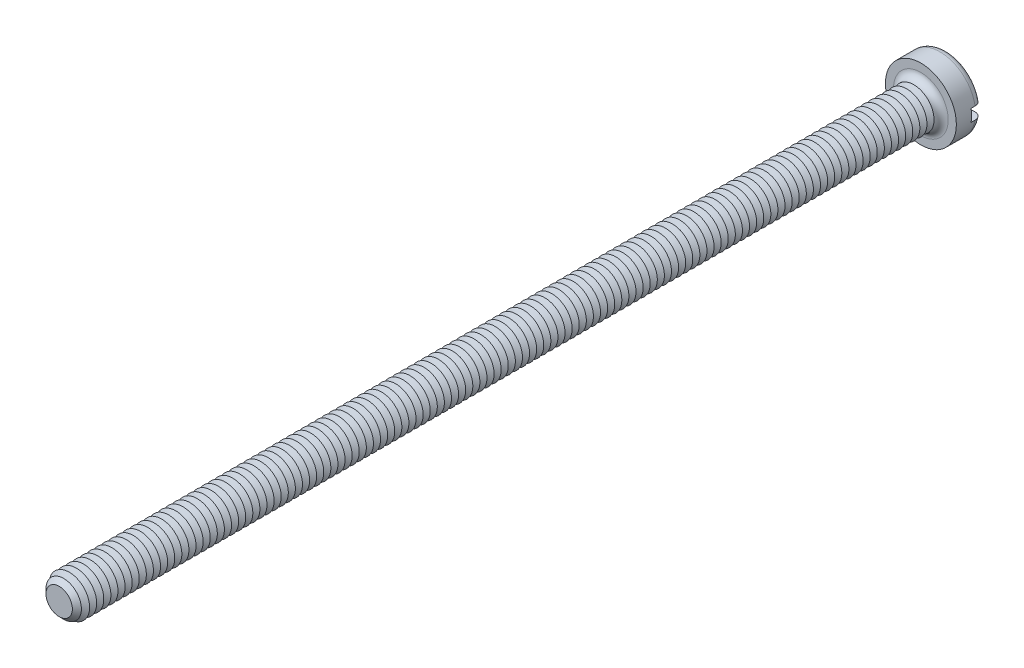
from build123d import *

# Parameters (mm, degrees)
SKETCH3_R           = 3.5
BOSS_EXTRUDE2_DEPTH = 2.6
SKETCH4_R           = 2
BOSS_EXTRUDE3_DEPTH = 85
FILLET1_R           = 0.7
CHAMFER1_SIZE       = 0.7
LPATTERN1_COUNT     = 120
LPATTERN1_PITCH     = 0.7
SKETCH8_W           = 7
SKETCH8_H           = 1.2
CUT_EXTRUDE1_DEPTH  = 1.1


with BuildPart() as part:
    # Sketch3 → Boss-Extrude2 (new body)
    with BuildSketch(Plane.XY):
        Circle(SKETCH3_R)
    extrude(amount=-BOSS_EXTRUDE2_DEPTH)

    # Sketch4 → Boss-Extrude3 (add)
    with BuildSketch(Plane.XY):
        Circle(SKETCH4_R)
    extrude(amount=BOSS_EXTRUDE3_DEPTH)

    # Fillet1
    fillet1_edges = [part.edges().sort_by_distance(p)[0] for p in [
        (-3.5, 0, -2.6),
        (-2, 0, 0),
    ]]
    fillet(fillet1_edges, radius=FILLET1_R)

    # Chamfer1
    chamfer1_edges = [part.edges().sort_by_distance(p)[0] for p in [
        (-2, 0, 85),
    ]]
    chamfer(chamfer1_edges, length=CHAMFER1_SIZE)

    # Sketch6 → Cut-Revolve1 (revolve, cut)
    with BuildSketch(Plane(origin=(0, 0, 0), x_dir=(0, 0, -1), z_dir=(1, 0, 0)), mode=Mode.PRIVATE) as cut_revolve1_sk:
        Polygon((-0.7, 2), (-1.05, 1.393782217), (-1.4, 2), align=None)
    cut_revolve1 = revolve(cut_revolve1_sk.sketch.rotate(Axis((0, 0, -1.694361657), (0, 0, 1)), 90), axis=Axis((0, 0, -1.694361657), (0, 0, 1)), mode=Mode.SUBTRACT)

    # LPattern1: Cut-Revolve1 ×120
    with Locations(*[(0, 0, i * LPATTERN1_PITCH) for i in range(1, LPATTERN1_COUNT)]):
        add(cut_revolve1, mode=Mode.SUBTRACT)

    # Sketch8 → Cut-Extrude1 (cut)
    with BuildSketch(Plane(origin=(0, 0, -2.6), x_dir=(-1, 0, 0), z_dir=(0, 0, -1))):
        Rectangle(SKETCH8_W, SKETCH8_H)
    extrude(amount=-CUT_EXTRUDE1_DEPTH, mode=Mode.SUBTRACT)


solid = part.part
